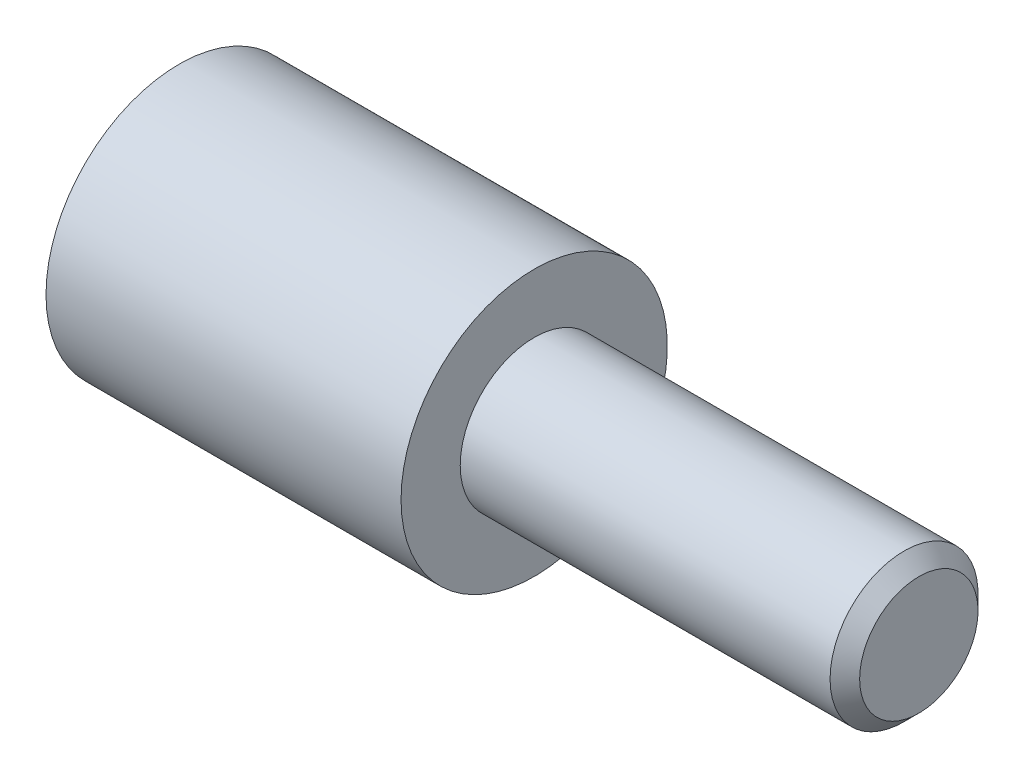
ISO-10303-21;
HEADER;
FILE_DESCRIPTION(('STEP AP214'),'2;1');
FILE_NAME('part.step','',(''),(''),'','','');
FILE_SCHEMA(('AUTOMOTIVE_DESIGN { 1 0 10303 214 1 1 1 1 }'));
ENDSEC;
DATA;
#1=APPLICATION_CONTEXT('core data for automotive mechanical design processes');
#2=APPLICATION_PROTOCOL_DEFINITION('international standard','automotive_design',2000,#1);
#3=PRODUCT_CONTEXT('',#1,'mechanical');
#4=PRODUCT('Part','Part','',(#3));
#5=PRODUCT_RELATED_PRODUCT_CATEGORY('part','',(#4));
#6=PRODUCT_DEFINITION_FORMATION('','',#4);
#7=PRODUCT_DEFINITION_CONTEXT('part definition',#1,'design');
#8=PRODUCT_DEFINITION('design','',#6,#7);
#9=PRODUCT_DEFINITION_SHAPE('','',#8);
#10=(LENGTH_UNIT() NAMED_UNIT(*) SI_UNIT(.MILLI.,.METRE.));
#11=(NAMED_UNIT(*) PLANE_ANGLE_UNIT() SI_UNIT($,.RADIAN.));
#12=(NAMED_UNIT(*) SI_UNIT($,.STERADIAN.) SOLID_ANGLE_UNIT());
#13=UNCERTAINTY_MEASURE_WITH_UNIT(LENGTH_MEASURE(1.E-05),#10,'distance_accuracy_value','');
#14=(GEOMETRIC_REPRESENTATION_CONTEXT(3) GLOBAL_UNCERTAINTY_ASSIGNED_CONTEXT((#13)) GLOBAL_UNIT_ASSIGNED_CONTEXT((#10,
#11,#12)) REPRESENTATION_CONTEXT('',''));
#15=CARTESIAN_POINT('',(0.,0.,0.));
#16=DIRECTION('',(0.,0.,1.));
#17=DIRECTION('',(1.,0.,0.));
#18=AXIS2_PLACEMENT_3D('',#15,#16,#17);
#19=CARTESIAN_POINT('',(-11.705244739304,0.,0.));
#20=DIRECTION('',(-1.,0.,0.));
#21=DIRECTION('',(0.,0.,1.));
#22=AXIS2_PLACEMENT_3D('',#19,#20,#21);
#23=CYLINDRICAL_SURFACE('',#22,4.5);
#24=CARTESIAN_POINT('',(0.,0.,0.));
#25=DIRECTION('',(-1.,0.,0.));
#26=DIRECTION('',(0.,0.,1.));
#27=AXIS2_PLACEMENT_3D('',#24,#25,#26);
#28=CIRCLE('',#27,4.5);
#29=CARTESIAN_POINT('',(0.,0.,4.5));
#30=VERTEX_POINT('',#29);
#31=EDGE_CURVE('E67',#30,#30,#28,.T.);
#32=ORIENTED_EDGE('',*,*,#31,.F.);
#33=EDGE_LOOP('',(#32));
#34=FACE_BOUND('',#33,.T.);
#35=CARTESIAN_POINT('',(12.,0.,0.));
#36=DIRECTION('',(-1.,0.,0.));
#37=DIRECTION('',(0.,0.,1.));
#38=AXIS2_PLACEMENT_3D('',#35,#36,#37);
#39=CIRCLE('',#38,4.5);
#40=CARTESIAN_POINT('',(12.,0.,4.5));
#41=VERTEX_POINT('',#40);
#42=EDGE_CURVE('E52',#41,#41,#39,.T.);
#43=ORIENTED_EDGE('',*,*,#42,.T.);
#44=EDGE_LOOP('',(#43));
#45=FACE_BOUND('',#44,.T.);
#46=ADVANCED_FACE('F41',(#34,#45),#23,.T.);
#47=CARTESIAN_POINT('',(12.,4.5,0.));
#48=DIRECTION('',(-1.,0.,0.));
#49=DIRECTION('',(0.,0.,1.));
#50=AXIS2_PLACEMENT_3D('',#47,#48,#49);
#51=PLANE('',#50);
#52=ORIENTED_EDGE('',*,*,#42,.F.);
#53=EDGE_LOOP('',(#52));
#54=FACE_BOUND('',#53,.T.);
#55=CARTESIAN_POINT('',(12.,0.,0.));
#56=DIRECTION('',(-1.,0.,0.));
#57=DIRECTION('',(0.,0.,1.));
#58=AXIS2_PLACEMENT_3D('',#55,#56,#57);
#59=CIRCLE('',#58,2.5);
#60=CARTESIAN_POINT('',(12.,0.,2.5));
#61=VERTEX_POINT('',#60);
#62=EDGE_CURVE('E56',#61,#61,#59,.T.);
#63=ORIENTED_EDGE('',*,*,#62,.T.);
#64=EDGE_LOOP('',(#63));
#65=FACE_BOUND('',#64,.T.);
#66=ADVANCED_FACE('F75',(#54,#65),#51,.F.);
#67=CARTESIAN_POINT('',(-11.705244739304,0.,0.));
#68=DIRECTION('',(-1.,0.,0.));
#69=DIRECTION('',(0.,0.,1.));
#70=AXIS2_PLACEMENT_3D('',#67,#68,#69);
#71=CYLINDRICAL_SURFACE('',#70,2.5);
#72=CARTESIAN_POINT('',(24.5,0.,0.));
#73=DIRECTION('',(-1.,0.,0.));
#74=DIRECTION('',(0.,0.,1.));
#75=AXIS2_PLACEMENT_3D('',#72,#73,#74);
#76=CIRCLE('',#75,2.5);
#77=CARTESIAN_POINT('',(24.5,0.,2.5));
#78=VERTEX_POINT('',#77);
#79=EDGE_CURVE('E48',#78,#78,#76,.T.);
#80=ORIENTED_EDGE('',*,*,#79,.T.);
#81=EDGE_LOOP('',(#80));
#82=FACE_BOUND('',#81,.T.);
#83=ORIENTED_EDGE('',*,*,#62,.F.);
#84=EDGE_LOOP('',(#83));
#85=FACE_BOUND('',#84,.T.);
#86=ADVANCED_FACE('F80',(#82,#85),#71,.T.);
#87=CARTESIAN_POINT('',(25.,2.5,0.));
#88=DIRECTION('',(-1.,0.,0.));
#89=DIRECTION('',(0.,0.,1.));
#90=AXIS2_PLACEMENT_3D('',#87,#88,#89);
#91=PLANE('',#90);
#92=CARTESIAN_POINT('',(25.,0.,0.));
#93=DIRECTION('',(-1.,0.,0.));
#94=DIRECTION('',(0.,0.,1.));
#95=AXIS2_PLACEMENT_3D('',#92,#93,#94);
#96=CIRCLE('',#95,1.99999999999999);
#97=CARTESIAN_POINT('',(25.,0.,1.99999999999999));
#98=VERTEX_POINT('',#97);
#99=EDGE_CURVE('E10',#98,#98,#96,.F.);
#100=ORIENTED_EDGE('',*,*,#99,.T.);
#101=EDGE_LOOP('',(#100));
#102=FACE_BOUND('',#101,.T.);
#103=ADVANCED_FACE('F85',(#102),#91,.F.);
#104=CARTESIAN_POINT('',(10.,0.,0.));
#105=DIRECTION('',(1.,0.,0.));
#106=DIRECTION('',(0.,0.,-1.));
#107=AXIS2_PLACEMENT_3D('',#104,#105,#106);
#108=PLANE('',#107);
#109=CARTESIAN_POINT('',(10.,0.,0.));
#110=DIRECTION('',(-1.,0.,0.));
#111=DIRECTION('',(0.,0.,1.));
#112=AXIS2_PLACEMENT_3D('',#109,#110,#111);
#113=CIRCLE('',#112,2.8);
#114=CARTESIAN_POINT('',(10.,0.,2.8));
#115=VERTEX_POINT('',#114);
#116=EDGE_CURVE('E61',#115,#115,#113,.T.);
#117=ORIENTED_EDGE('',*,*,#116,.T.);
#118=EDGE_LOOP('',(#117));
#119=FACE_BOUND('',#118,.T.);
#120=ADVANCED_FACE('F90',(#119),#108,.F.);
#121=CARTESIAN_POINT('',(-11.705244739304,0.,0.));
#122=DIRECTION('',(-1.,0.,0.));
#123=DIRECTION('',(0.,0.,1.));
#124=AXIS2_PLACEMENT_3D('',#121,#122,#123);
#125=CYLINDRICAL_SURFACE('',#124,2.8);
#126=ORIENTED_EDGE('',*,*,#116,.F.);
#127=EDGE_LOOP('',(#126));
#128=FACE_BOUND('',#127,.T.);
#129=CARTESIAN_POINT('',(0.,0.,0.));
#130=DIRECTION('',(-1.,0.,0.));
#131=DIRECTION('',(0.,0.,1.));
#132=AXIS2_PLACEMENT_3D('',#129,#130,#131);
#133=CIRCLE('',#132,2.8);
#134=CARTESIAN_POINT('',(0.,0.,2.8));
#135=VERTEX_POINT('',#134);
#136=EDGE_CURVE('E64',#135,#135,#133,.T.);
#137=ORIENTED_EDGE('',*,*,#136,.T.);
#138=EDGE_LOOP('',(#137));
#139=FACE_BOUND('',#138,.T.);
#140=ADVANCED_FACE('F95',(#128,#139),#125,.F.);
#141=CARTESIAN_POINT('',(0.,2.8,0.));
#142=DIRECTION('',(1.,0.,0.));
#143=DIRECTION('',(0.,0.,-1.));
#144=AXIS2_PLACEMENT_3D('',#141,#142,#143);
#145=PLANE('',#144);
#146=ORIENTED_EDGE('',*,*,#136,.F.);
#147=EDGE_LOOP('',(#146));
#148=FACE_BOUND('',#147,.T.);
#149=ORIENTED_EDGE('',*,*,#31,.T.);
#150=EDGE_LOOP('',(#149));
#151=FACE_BOUND('',#150,.T.);
#152=ADVANCED_FACE('F71',(#148,#151),#145,.F.);
#153=CARTESIAN_POINT('',(24.5,0.,0.));
#154=DIRECTION('',(-1.,0.,0.));
#155=DIRECTION('',(0.,0.,1.));
#156=AXIS2_PLACEMENT_3D('',#153,#154,#155);
#157=CONICAL_SURFACE('',#156,2.5,0.785398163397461);
#158=ORIENTED_EDGE('',*,*,#99,.F.);
#159=EDGE_LOOP('',(#158));
#160=FACE_BOUND('',#159,.T.);
#161=ORIENTED_EDGE('',*,*,#79,.F.);
#162=EDGE_LOOP('',(#161));
#163=FACE_BOUND('',#162,.T.);
#164=ADVANCED_FACE('F43',(#160,#163),#157,.T.);
#165=CLOSED_SHELL('',(#46,#66,#86,#103,#120,#140,#152,#164));
#166=MANIFOLD_SOLID_BREP('B2',#165);
#167=ADVANCED_BREP_SHAPE_REPRESENTATION('',(#18,#166),#14);
#168=SHAPE_DEFINITION_REPRESENTATION(#9,#167);
ENDSEC;
END-ISO-10303-21;
